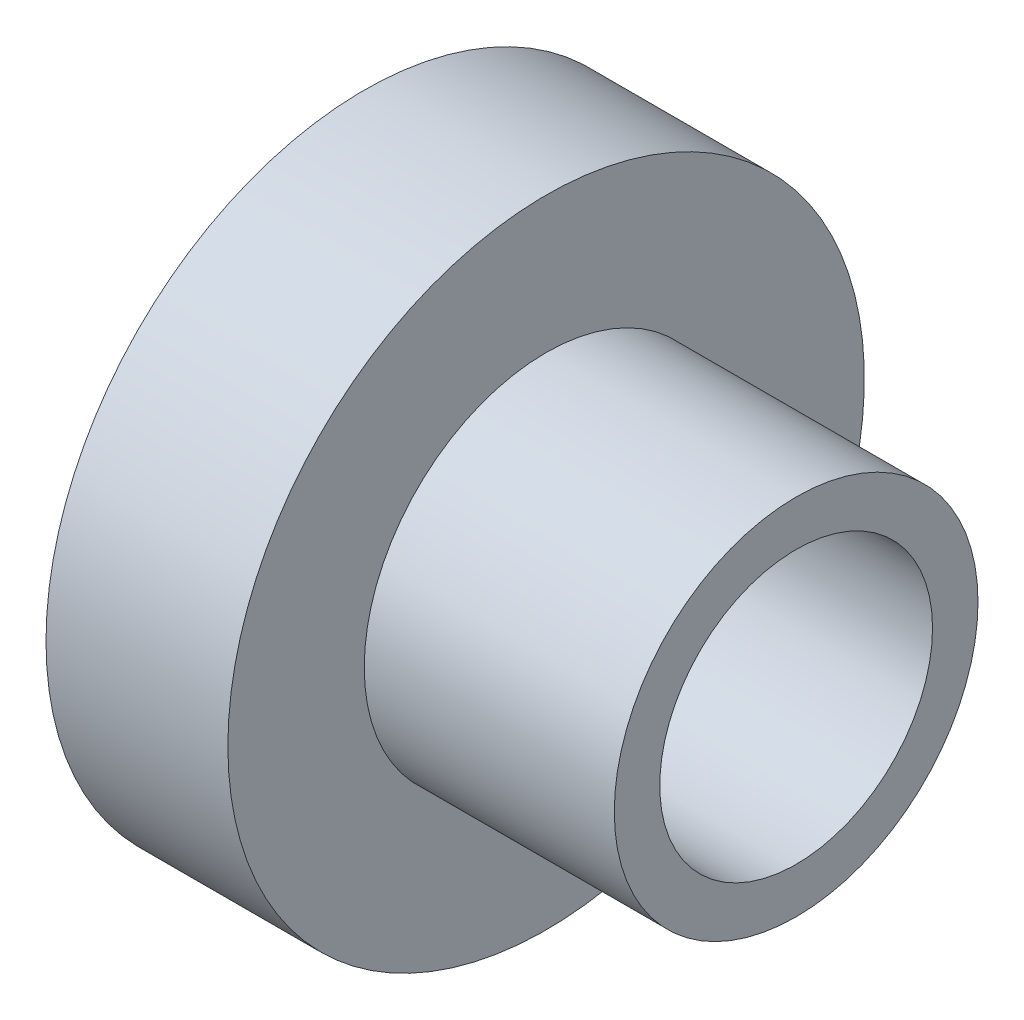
ISO-10303-21;
HEADER;
FILE_DESCRIPTION(('STEP AP214'),'2;1');
FILE_NAME('part.step','',(''),(''),'','','');
FILE_SCHEMA(('AUTOMOTIVE_DESIGN { 1 0 10303 214 1 1 1 1 }'));
ENDSEC;
DATA;
#1=APPLICATION_CONTEXT('core data for automotive mechanical design processes');
#2=APPLICATION_PROTOCOL_DEFINITION('international standard','automotive_design',2000,#1);
#3=PRODUCT_CONTEXT('',#1,'mechanical');
#4=PRODUCT('Part','Part','',(#3));
#5=PRODUCT_RELATED_PRODUCT_CATEGORY('part','',(#4));
#6=PRODUCT_DEFINITION_FORMATION('','',#4);
#7=PRODUCT_DEFINITION_CONTEXT('part definition',#1,'design');
#8=PRODUCT_DEFINITION('design','',#6,#7);
#9=PRODUCT_DEFINITION_SHAPE('','',#8);
#10=(LENGTH_UNIT() NAMED_UNIT(*) SI_UNIT(.MILLI.,.METRE.));
#11=(NAMED_UNIT(*) PLANE_ANGLE_UNIT() SI_UNIT($,.RADIAN.));
#12=(NAMED_UNIT(*) SI_UNIT($,.STERADIAN.) SOLID_ANGLE_UNIT());
#13=UNCERTAINTY_MEASURE_WITH_UNIT(LENGTH_MEASURE(1.E-05),#10,'distance_accuracy_value','');
#14=(GEOMETRIC_REPRESENTATION_CONTEXT(3) GLOBAL_UNCERTAINTY_ASSIGNED_CONTEXT((#13)) GLOBAL_UNIT_ASSIGNED_CONTEXT((#10,
#11,#12)) REPRESENTATION_CONTEXT('',''));
#15=CARTESIAN_POINT('',(0.,0.,0.));
#16=DIRECTION('',(0.,0.,1.));
#17=DIRECTION('',(1.,0.,0.));
#18=AXIS2_PLACEMENT_3D('',#15,#16,#17);
#19=CARTESIAN_POINT('',(0.,0.,-6.99999999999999));
#20=DIRECTION('',(1.,0.,0.));
#21=DIRECTION('',(0.,0.,-1.));
#22=AXIS2_PLACEMENT_3D('',#19,#20,#21);
#23=PLANE('',#22);
#24=CARTESIAN_POINT('',(0.,0.,0.));
#25=DIRECTION('',(1.,0.,0.));
#26=DIRECTION('',(0.,0.,-1.));
#27=AXIS2_PLACEMENT_3D('',#24,#25,#26);
#28=CIRCLE('',#27,3.);
#29=CARTESIAN_POINT('',(0.,0.,-3.));
#30=VERTEX_POINT('',#29);
#31=EDGE_CURVE('E49',#30,#30,#28,.T.);
#32=ORIENTED_EDGE('',*,*,#31,.T.);
#33=EDGE_LOOP('',(#32));
#34=FACE_BOUND('',#33,.T.);
#35=CARTESIAN_POINT('',(0.,0.,0.));
#36=DIRECTION('',(-1.,0.,0.));
#37=DIRECTION('',(0.,0.,1.));
#38=AXIS2_PLACEMENT_3D('',#35,#36,#37);
#39=CIRCLE('',#38,6.99999999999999);
#40=CARTESIAN_POINT('',(0.,0.,6.99999999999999));
#41=VERTEX_POINT('',#40);
#42=EDGE_CURVE('E44',#41,#41,#39,.T.);
#43=ORIENTED_EDGE('',*,*,#42,.T.);
#44=EDGE_LOOP('',(#43));
#45=FACE_BOUND('',#44,.T.);
#46=ADVANCED_FACE('F30',(#34,#45),#23,.F.);
#47=CARTESIAN_POINT('',(9.49999999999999,0.,0.));
#48=DIRECTION('',(-1.,0.,0.));
#49=DIRECTION('',(0.,0.,1.));
#50=AXIS2_PLACEMENT_3D('',#47,#48,#49);
#51=PLANE('',#50);
#52=CARTESIAN_POINT('',(9.49999999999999,0.,0.));
#53=DIRECTION('',(1.,0.,0.));
#54=DIRECTION('',(0.,0.,-1.));
#55=AXIS2_PLACEMENT_3D('',#52,#53,#54);
#56=CIRCLE('',#55,3.);
#57=CARTESIAN_POINT('',(9.49999999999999,0.,-3.));
#58=VERTEX_POINT('',#57);
#59=EDGE_CURVE('E52',#58,#58,#56,.T.);
#60=ORIENTED_EDGE('',*,*,#59,.F.);
#61=EDGE_LOOP('',(#60));
#62=FACE_BOUND('',#61,.T.);
#63=CARTESIAN_POINT('',(9.49999999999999,0.,0.));
#64=DIRECTION('',(-1.,0.,0.));
#65=DIRECTION('',(0.,0.,1.));
#66=AXIS2_PLACEMENT_3D('',#63,#64,#65);
#67=CIRCLE('',#66,3.99999999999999);
#68=CARTESIAN_POINT('',(9.49999999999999,0.,3.99999999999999));
#69=VERTEX_POINT('',#68);
#70=EDGE_CURVE('E10',#69,#69,#67,.T.);
#71=ORIENTED_EDGE('',*,*,#70,.F.);
#72=EDGE_LOOP('',(#71));
#73=FACE_BOUND('',#72,.T.);
#74=ADVANCED_FACE('F58',(#62,#73),#51,.F.);
#75=CARTESIAN_POINT('',(0.,0.,0.));
#76=DIRECTION('',(-1.,0.,0.));
#77=DIRECTION('',(0.,0.,1.));
#78=AXIS2_PLACEMENT_3D('',#75,#76,#77);
#79=CYLINDRICAL_SURFACE('',#78,3.99999999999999);
#80=CARTESIAN_POINT('',(4.,0.,0.));
#81=DIRECTION('',(-1.,0.,0.));
#82=DIRECTION('',(0.,0.,1.));
#83=AXIS2_PLACEMENT_3D('',#80,#81,#82);
#84=CIRCLE('',#83,3.99999999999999);
#85=CARTESIAN_POINT('',(4.,0.,3.99999999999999));
#86=VERTEX_POINT('',#85);
#87=EDGE_CURVE('E36',#86,#86,#84,.T.);
#88=ORIENTED_EDGE('',*,*,#87,.F.);
#89=EDGE_LOOP('',(#88));
#90=FACE_BOUND('',#89,.T.);
#91=ORIENTED_EDGE('',*,*,#70,.T.);
#92=EDGE_LOOP('',(#91));
#93=FACE_BOUND('',#92,.T.);
#94=ADVANCED_FACE('F61',(#90,#93),#79,.T.);
#95=CARTESIAN_POINT('',(4.,0.,-3.99999999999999));
#96=DIRECTION('',(-1.,0.,0.));
#97=DIRECTION('',(0.,0.,1.));
#98=AXIS2_PLACEMENT_3D('',#95,#96,#97);
#99=PLANE('',#98);
#100=CARTESIAN_POINT('',(4.,0.,0.));
#101=DIRECTION('',(-1.,0.,0.));
#102=DIRECTION('',(0.,0.,1.));
#103=AXIS2_PLACEMENT_3D('',#100,#101,#102);
#104=CIRCLE('',#103,6.99999999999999);
#105=CARTESIAN_POINT('',(4.,0.,6.99999999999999));
#106=VERTEX_POINT('',#105);
#107=EDGE_CURVE('E40',#106,#106,#104,.T.);
#108=ORIENTED_EDGE('',*,*,#107,.F.);
#109=EDGE_LOOP('',(#108));
#110=FACE_BOUND('',#109,.T.);
#111=ORIENTED_EDGE('',*,*,#87,.T.);
#112=EDGE_LOOP('',(#111));
#113=FACE_BOUND('',#112,.T.);
#114=ADVANCED_FACE('F66',(#110,#113),#99,.F.);
#115=CARTESIAN_POINT('',(0.,0.,0.));
#116=DIRECTION('',(-1.,0.,0.));
#117=DIRECTION('',(0.,0.,1.));
#118=AXIS2_PLACEMENT_3D('',#115,#116,#117);
#119=CYLINDRICAL_SURFACE('',#118,6.99999999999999);
#120=ORIENTED_EDGE('',*,*,#42,.F.);
#121=EDGE_LOOP('',(#120));
#122=FACE_BOUND('',#121,.T.);
#123=ORIENTED_EDGE('',*,*,#107,.T.);
#124=EDGE_LOOP('',(#123));
#125=FACE_BOUND('',#124,.T.);
#126=ADVANCED_FACE('F73',(#122,#125),#119,.T.);
#127=CARTESIAN_POINT('',(0.,0.,0.));
#128=DIRECTION('',(1.,0.,0.));
#129=DIRECTION('',(0.,0.,-1.));
#130=AXIS2_PLACEMENT_3D('',#127,#128,#129);
#131=CYLINDRICAL_SURFACE('',#130,3.);
#132=ORIENTED_EDGE('',*,*,#31,.F.);
#133=EDGE_LOOP('',(#132));
#134=FACE_BOUND('',#133,.T.);
#135=ORIENTED_EDGE('',*,*,#59,.T.);
#136=EDGE_LOOP('',(#135));
#137=FACE_BOUND('',#136,.T.);
#138=ADVANCED_FACE('F56',(#134,#137),#131,.F.);
#139=CLOSED_SHELL('',(#46,#74,#94,#114,#126,#138));
#140=MANIFOLD_SOLID_BREP('B2',#139);
#141=ADVANCED_BREP_SHAPE_REPRESENTATION('',(#18,#140),#14);
#142=SHAPE_DEFINITION_REPRESENTATION(#9,#141);
ENDSEC;
END-ISO-10303-21;
